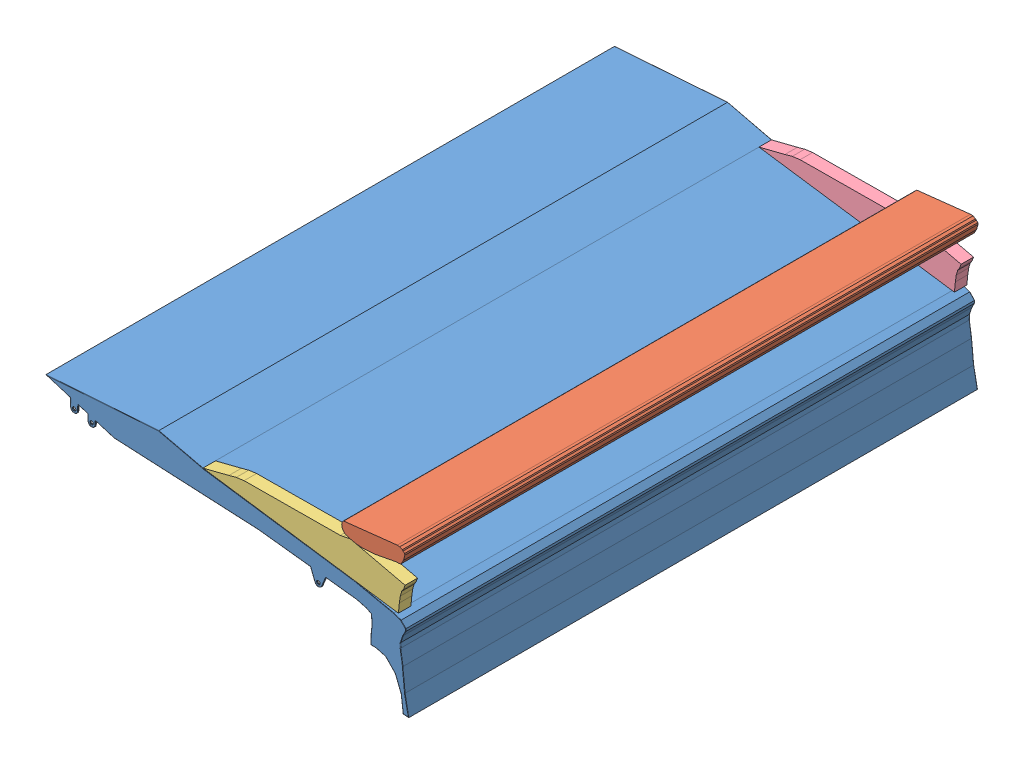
SolidWorks assembly Lid.SLDASM, configuration Default (file format 11000). Lengths in mm.
Overall size (747.13 295.39 1169.04).
4 component instances, 4 part files, 9 mates.
Components (placement in the parent):
- Lid-1: Lid.SLDPRT [Default] at (-2.1791 0.6812 -0.1532) x (0.999874 -0.015904 0) z (0 0 1) size (743.34 244.04 1160)
- Part-19-1: Part-19.sldprt [Default] at (51.5811 -172.1135 570.8118) x (0.992853 0.119343 0) z (0 0 1) size (129 34 1168.4)
- Part-20-1: Part-20.sldprt [Default] at (42.7223 -132.4509 570.8118) x (0.999973 0.007415 0) z (0 0 1) size (412 83 25.4)
- MirrorPart-20-1: MirrorPart-20.sldprt [Default] at (42.7223 -132.4509 589.1882) x (0.999973 0.007415 0) z (0 0 1) size (412 83 25.4)
Mates (geometry in assembly coordinates):
- Coincident7: coincident: plane of assembly; plane of assembly; plane of Lid-1 through (632.1044 -49.4125 -580.1532) normal (0.141733 0.989905 0); plane of Part-20-1 through (317.7804 -4.408 553.8118) normal (-0.141733 -0.989905 0)
- Coincident8: coincident: point of assembly; point of assembly; point of Lid-1; point of Part-20-1
- Coincident11: coincident: point of assembly; line of assembly; point of Lid-1; line of Part-20-1 through (317.7804 -4.408 579.2118) axis (0.989905 -0.141733 0)
- Coincident12: coincident: plane of assembly; plane of assembly; plane of Lid-1 through (632.1044 -49.4125 -580.1532) normal (0.141733 0.989905 0); plane of MirrorPart-20-1 through (317.7804 -4.408 -554.1182) normal (-0.141733 -0.989905 0)
- Coincident13: coincident: point of assembly; point of assembly; point of Lid-1; point of MirrorPart-20-1
- Coincident14: coincident: point of assembly; line of assembly; point of Lid-1; line of MirrorPart-20-1 through (317.7804 -4.408 -579.5182) axis (0.989905 -0.141733 0)
- Coincident15: coincident: plane of assembly; plane of assembly; plane of Part-19-1 through (617.6016 20.8158 -589.1882) normal (-0.227143 -0.973861 0); plane of Part-20-1 through (729.7988 -5.353 553.8118) normal (0.227143 0.973861 0)
- Coincident16: coincident: plane of assembly; plane of assembly; plane of Part-19-1 through (596.0896 38.1821 579.2118) normal (0 0 1); plane of Part-20-1 through (732.0458 100.4668 579.2118) normal (0 0 1)
- Coincident18: coincident: point of assembly; point of assembly; point of Part-19-1; point of Part-20-1
